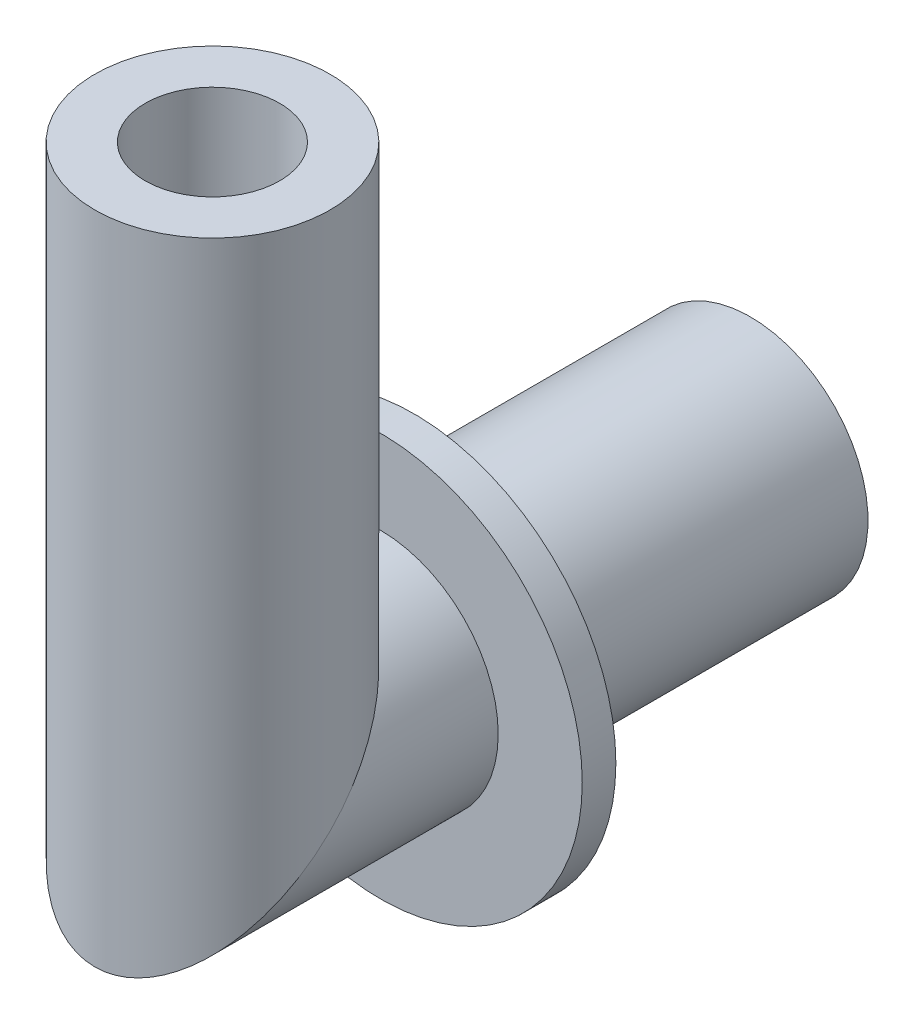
ISO-10303-21;
HEADER;
FILE_DESCRIPTION(('STEP AP214'),'2;1');
FILE_NAME('part.step','',(''),(''),'','','');
FILE_SCHEMA(('AUTOMOTIVE_DESIGN { 1 0 10303 214 1 1 1 1 }'));
ENDSEC;
DATA;
#1=APPLICATION_CONTEXT('core data for automotive mechanical design processes');
#2=APPLICATION_PROTOCOL_DEFINITION('international standard','automotive_design',2000,#1);
#3=PRODUCT_CONTEXT('',#1,'mechanical');
#4=PRODUCT('Part','Part','',(#3));
#5=PRODUCT_RELATED_PRODUCT_CATEGORY('part','',(#4));
#6=PRODUCT_DEFINITION_FORMATION('','',#4);
#7=PRODUCT_DEFINITION_CONTEXT('part definition',#1,'design');
#8=PRODUCT_DEFINITION('design','',#6,#7);
#9=PRODUCT_DEFINITION_SHAPE('','',#8);
#10=(LENGTH_UNIT() NAMED_UNIT(*) SI_UNIT(.MILLI.,.METRE.));
#11=(NAMED_UNIT(*) PLANE_ANGLE_UNIT() SI_UNIT($,.RADIAN.));
#12=(NAMED_UNIT(*) SI_UNIT($,.STERADIAN.) SOLID_ANGLE_UNIT());
#13=UNCERTAINTY_MEASURE_WITH_UNIT(LENGTH_MEASURE(1.E-05),#10,'distance_accuracy_value','');
#14=(GEOMETRIC_REPRESENTATION_CONTEXT(3) GLOBAL_UNCERTAINTY_ASSIGNED_CONTEXT((#13)) GLOBAL_UNIT_ASSIGNED_CONTEXT((#10,
#11,#12)) REPRESENTATION_CONTEXT('',''));
#15=CARTESIAN_POINT('',(0.,0.,0.));
#16=DIRECTION('',(0.,0.,1.));
#17=DIRECTION('',(1.,0.,0.));
#18=AXIS2_PLACEMENT_3D('',#15,#16,#17);
#19=CARTESIAN_POINT('',(0.,-25.4,44.3702241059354));
#20=DIRECTION('',(0.,0.,-1.));
#21=DIRECTION('',(-1.,0.,0.));
#22=AXIS2_PLACEMENT_3D('',#19,#20,#21);
#23=CYLINDRICAL_SURFACE('',#22,5.55625);
#24=CARTESIAN_POINT('',(0.,-25.4,15.8749999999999));
#25=DIRECTION('',(0.,0.,1.));
#26=DIRECTION('',(1.,0.,0.));
#27=AXIS2_PLACEMENT_3D('',#24,#25,#26);
#28=CIRCLE('',#27,5.55625);
#29=CARTESIAN_POINT('',(-5.55625,-25.4,15.8749999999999));
#30=VERTEX_POINT('',#29);
#31=EDGE_CURVE('E69',#30,#30,#28,.T.);
#32=CARTESIAN_POINT('',(0.,-25.4,0.));
#33=DIRECTION('',(0.,0.,1.));
#34=DIRECTION('',(1.,0.,0.));
#35=AXIS2_PLACEMENT_3D('',#32,#33,#34);
#36=CIRCLE('',#35,5.55625);
#37=CARTESIAN_POINT('',(-5.55625,-25.4,0.));
#38=VERTEX_POINT('',#37);
#39=EDGE_CURVE('E34',#38,#38,#36,.T.);
#40=CARTESIAN_POINT('',(-5.55625,-25.4,15.8749999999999));
#41=CARTESIAN_POINT('',(-5.55625,-25.4,15.7096354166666));
#42=CARTESIAN_POINT('',(-5.55625,-25.4,15.5442708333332));
#43=CARTESIAN_POINT('',(-5.55625,-25.4,15.2135416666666));
#44=CARTESIAN_POINT('',(-5.55625,-25.4,15.0481770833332));
#45=CARTESIAN_POINT('',(-5.55625,-25.4,14.7174479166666));
#46=CARTESIAN_POINT('',(-5.55625,-25.4,14.5520833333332));
#47=CARTESIAN_POINT('',(-5.55625,-25.4,14.2213541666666));
#48=CARTESIAN_POINT('',(-5.55625,-25.4,14.0559895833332));
#49=CARTESIAN_POINT('',(-5.55625,-25.4,13.7252604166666));
#50=CARTESIAN_POINT('',(-5.55625,-25.4,13.5598958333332));
#51=CARTESIAN_POINT('',(-5.55625,-25.4,13.2291666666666));
#52=CARTESIAN_POINT('',(-5.55625,-25.4,13.0638020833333));
#53=CARTESIAN_POINT('',(-5.55625,-25.4,12.7330729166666));
#54=CARTESIAN_POINT('',(-5.55625,-25.4,12.5677083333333));
#55=CARTESIAN_POINT('',(-5.55625,-25.4,12.2369791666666));
#56=CARTESIAN_POINT('',(-5.55625,-25.4,12.0716145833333));
#57=CARTESIAN_POINT('',(-5.55625,-25.4,11.7408854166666));
#58=CARTESIAN_POINT('',(-5.55625,-25.4,11.5755208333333));
#59=CARTESIAN_POINT('',(-5.55625,-25.4,11.2447916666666));
#60=CARTESIAN_POINT('',(-5.55625,-25.4,11.0794270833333));
#61=CARTESIAN_POINT('',(-5.55625,-25.4,10.7486979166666));
#62=CARTESIAN_POINT('',(-5.55625,-25.4,10.5833333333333));
#63=CARTESIAN_POINT('',(-5.55625,-25.4,10.2526041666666));
#64=CARTESIAN_POINT('',(-5.55625,-25.4,10.0872395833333));
#65=CARTESIAN_POINT('',(-5.55625,-25.4,9.75651041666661));
#66=CARTESIAN_POINT('',(-5.55625,-25.4,9.59114583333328));
#67=CARTESIAN_POINT('',(-5.55625,-25.4,9.26041666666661));
#68=CARTESIAN_POINT('',(-5.55625,-25.4,9.09505208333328));
#69=CARTESIAN_POINT('',(-5.55625,-25.4,8.76432291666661));
#70=CARTESIAN_POINT('',(-5.55625,-25.4,8.59895833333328));
#71=CARTESIAN_POINT('',(-5.55625,-25.4,8.26822916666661));
#72=CARTESIAN_POINT('',(-5.55625,-25.4,8.10286458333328));
#73=CARTESIAN_POINT('',(-5.55625,-25.4,7.77213541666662));
#74=CARTESIAN_POINT('',(-5.55625,-25.4,7.60677083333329));
#75=CARTESIAN_POINT('',(-5.55625,-25.4,7.27604166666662));
#76=CARTESIAN_POINT('',(-5.55625,-25.4,7.11067708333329));
#77=CARTESIAN_POINT('',(-5.55625,-25.4,6.77994791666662));
#78=CARTESIAN_POINT('',(-5.55625,-25.4,6.61458333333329));
#79=CARTESIAN_POINT('',(-5.55625,-25.4,6.28385416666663));
#80=CARTESIAN_POINT('',(-5.55625,-25.4,6.11848958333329));
#81=CARTESIAN_POINT('',(-5.55625,-25.4,5.78776041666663));
#82=CARTESIAN_POINT('',(-5.55625,-25.4,5.6223958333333));
#83=CARTESIAN_POINT('',(-5.55625,-25.4,5.29166666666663));
#84=CARTESIAN_POINT('',(-5.55625,-25.4,5.1263020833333));
#85=CARTESIAN_POINT('',(-5.55625,-25.4,4.79557291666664));
#86=CARTESIAN_POINT('',(-5.55625,-25.4,4.63020833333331));
#87=CARTESIAN_POINT('',(-5.55625,-25.4,4.29947916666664));
#88=CARTESIAN_POINT('',(-5.55625,-25.4,4.13411458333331));
#89=CARTESIAN_POINT('',(-5.55625,-25.4,3.80338541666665));
#90=CARTESIAN_POINT('',(-5.55625,-25.4,3.63802083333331));
#91=CARTESIAN_POINT('',(-5.55625,-25.4,3.30729166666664));
#92=CARTESIAN_POINT('',(-5.55625,-25.4,3.14192708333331));
#93=CARTESIAN_POINT('',(-5.55625,-25.4,2.81119791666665));
#94=CARTESIAN_POINT('',(-5.55625,-25.4,2.64583333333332));
#95=CARTESIAN_POINT('',(-5.55625,-25.4,2.31510416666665));
#96=CARTESIAN_POINT('',(-5.55625,-25.4,2.14973958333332));
#97=CARTESIAN_POINT('',(-5.55625,-25.4,1.81901041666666));
#98=CARTESIAN_POINT('',(-5.55625,-25.4,1.65364583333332));
#99=CARTESIAN_POINT('',(-5.55625,-25.4,1.32291666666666));
#100=CARTESIAN_POINT('',(-5.55625,-25.4,1.15755208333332));
#101=CARTESIAN_POINT('',(-5.55625,-25.4,0.826822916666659));
#102=CARTESIAN_POINT('',(-5.55625,-25.4,0.661458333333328));
#103=CARTESIAN_POINT('',(-5.55625,-25.4,0.330729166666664));
#104=CARTESIAN_POINT('',(-5.55625,-25.4,0.165364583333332));
#105=CARTESIAN_POINT('',(-5.55625,-25.4,0.));
#106=B_SPLINE_CURVE_WITH_KNOTS('',3,(#40,#41,#42,#43,#44,#45,#46,#47,#48,#49,#50,#51,#52,#53,
#54,#55,#56,#57,#58,#59,#60,#61,#62,#63,#64,#65,#66,#67,#68,#69,#70,#71,#72,#73,#74,#75,#76,#77,
#78,#79,#80,#81,#82,#83,#84,#85,#86,#87,#88,#89,#90,#91,#92,#93,#94,#95,#96,#97,#98,#99,#100,
#101,#102,#103,#104,#105),.UNSPECIFIED.,.F.,.F.,(4,2,2,2,2,2,2,2,2,2,2,2,2,2,2,2,2,2,2,2,2,2,2,
2,2,2,2,2,2,2,2,2,4),(0.,0.496093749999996,0.992187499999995,1.48828124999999,1.98437499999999,
2.48046874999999,2.97656249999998,3.47265624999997,3.96874999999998,4.46484374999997,
4.96093749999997,5.45703124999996,5.95312499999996,6.44921874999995,6.94531249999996,
7.44140624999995,7.93749999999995,8.43359374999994,8.92968749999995,9.42578124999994,
9.92187499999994,10.4179687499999,10.9140624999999,11.4101562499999,11.9062499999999,
12.4023437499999,12.8984374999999,13.3945312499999,13.8906249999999,14.3867187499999,
14.8828124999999,15.3789062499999,15.8749999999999),.UNSPECIFIED.);
#107=EDGE_CURVE('BSEAM30',#30,#38,#106,.T.);
#108=ORIENTED_EDGE('',*,*,#31,.F.);
#109=ORIENTED_EDGE('',*,*,#39,.T.);
#110=ORIENTED_EDGE('',*,*,#107,.T.);
#111=ORIENTED_EDGE('',*,*,#107,.F.);
#112=EDGE_LOOP('',(#108,#110,#109,#111));
#113=FACE_BOUND('',#112,.T.);
#114=ADVANCED_FACE('F30',(#113),#23,.T.);
#115=CARTESIAN_POINT('',(0.,-25.4,17.4624999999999));
#116=DIRECTION('',(0.,0.,1.));
#117=DIRECTION('',(1.,0.,0.));
#118=AXIS2_PLACEMENT_3D('',#115,#116,#117);
#119=CIRCLE('',#118,5.55625);
#120=CARTESIAN_POINT('',(5.55625,-25.4,17.4624999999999));
#121=VERTEX_POINT('',#120);
#122=EDGE_CURVE('E66',#121,#121,#119,.T.);
#123=ORIENTED_EDGE('',*,*,#122,.T.);
#124=EDGE_LOOP('',(#123));
#125=FACE_BOUND('',#124,.T.);
#126=CARTESIAN_POINT('',(0.,-25.4,25.3999999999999));
#127=DIRECTION('',(0.,0.707106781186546,0.707106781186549));
#128=DIRECTION('',(0.,0.707106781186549,-0.707106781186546));
#129=AXIS2_PLACEMENT_3D('',#126,#127,#128);
#130=ELLIPSE('',#129,7.8577241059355,5.55625);
#131=CARTESIAN_POINT('',(0.,-19.84375,19.8437499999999));
#132=VERTEX_POINT('',#131);
#133=EDGE_CURVE('E10',#132,#132,#130,.T.);
#134=ORIENTED_EDGE('',*,*,#133,.F.);
#135=EDGE_LOOP('',(#134));
#136=FACE_BOUND('',#135,.T.);
#137=ADVANCED_FACE('F32',(#125,#136),#23,.T.);
#138=CARTESIAN_POINT('',(0.,-25.4,0.));
#139=DIRECTION('',(0.,0.,1.));
#140=DIRECTION('',(1.,0.,0.));
#141=AXIS2_PLACEMENT_3D('',#138,#139,#140);
#142=PLANE('',#141);
#143=ORIENTED_EDGE('',*,*,#39,.F.);
#144=EDGE_LOOP('',(#143));
#145=FACE_BOUND('',#144,.T.);
#146=CARTESIAN_POINT('',(0.,-25.4,0.));
#147=DIRECTION('',(0.,0.,1.));
#148=DIRECTION('',(1.,0.,0.));
#149=AXIS2_PLACEMENT_3D('',#146,#147,#148);
#150=CIRCLE('',#149,3.175);
#151=CARTESIAN_POINT('',(3.175,-25.4,0.));
#152=VERTEX_POINT('',#151);
#153=EDGE_CURVE('E42',#152,#152,#150,.T.);
#154=ORIENTED_EDGE('',*,*,#153,.T.);
#155=EDGE_LOOP('',(#154));
#156=FACE_BOUND('',#155,.T.);
#157=ADVANCED_FACE('F80',(#145,#156),#142,.F.);
#158=CARTESIAN_POINT('',(0.,-25.4,44.3702241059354));
#159=DIRECTION('',(0.,0.,-1.));
#160=DIRECTION('',(-1.,0.,0.));
#161=AXIS2_PLACEMENT_3D('',#158,#159,#160);
#162=CYLINDRICAL_SURFACE('',#161,3.175);
#163=ORIENTED_EDGE('',*,*,#153,.F.);
#164=EDGE_LOOP('',(#163));
#165=FACE_BOUND('',#164,.T.);
#166=CARTESIAN_POINT('',(0.,-25.4,25.3999999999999));
#167=DIRECTION('',(0.,0.707106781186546,0.707106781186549));
#168=DIRECTION('',(0.,0.707106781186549,-0.707106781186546));
#169=AXIS2_PLACEMENT_3D('',#166,#167,#168);
#170=ELLIPSE('',#169,4.49012806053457,3.17499999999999);
#171=CARTESIAN_POINT('',(0.,-22.225,22.2249999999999));
#172=VERTEX_POINT('',#171);
#173=EDGE_CURVE('E44',#172,#172,#170,.F.);
#174=ORIENTED_EDGE('',*,*,#173,.F.);
#175=EDGE_LOOP('',(#174));
#176=FACE_BOUND('',#175,.T.);
#177=ADVANCED_FACE('F82',(#165,#176),#162,.F.);
#178=CARTESIAN_POINT('',(0.,-44.3702241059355,25.3999999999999));
#179=DIRECTION('',(0.,1.,0.));
#180=DIRECTION('',(0.,0.,1.));
#181=AXIS2_PLACEMENT_3D('',#178,#179,#180);
#182=CYLINDRICAL_SURFACE('',#181,5.55624999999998);
#183=ORIENTED_EDGE('',*,*,#133,.T.);
#184=EDGE_LOOP('',(#183));
#185=FACE_BOUND('',#184,.T.);
#186=CARTESIAN_POINT('',(0.,0.,25.3999999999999));
#187=DIRECTION('',(0.,1.,0.));
#188=DIRECTION('',(0.,0.,1.));
#189=AXIS2_PLACEMENT_3D('',#186,#187,#188);
#190=CIRCLE('',#189,5.55624999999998);
#191=CARTESIAN_POINT('',(0.,0.,30.9562499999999));
#192=VERTEX_POINT('',#191);
#193=EDGE_CURVE('E50',#192,#192,#190,.T.);
#194=ORIENTED_EDGE('',*,*,#193,.F.);
#195=EDGE_LOOP('',(#194));
#196=FACE_BOUND('',#195,.T.);
#197=ADVANCED_FACE('F87',(#185,#196),#182,.T.);
#198=CARTESIAN_POINT('',(0.,0.,25.3999999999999));
#199=DIRECTION('',(0.,1.,0.));
#200=DIRECTION('',(0.,0.,1.));
#201=AXIS2_PLACEMENT_3D('',#198,#199,#200);
#202=PLANE('',#201);
#203=CARTESIAN_POINT('',(0.,0.,25.3999999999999));
#204=DIRECTION('',(0.,1.,0.));
#205=DIRECTION('',(0.,0.,1.));
#206=AXIS2_PLACEMENT_3D('',#203,#204,#205);
#207=CIRCLE('',#206,3.17499999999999);
#208=CARTESIAN_POINT('',(0.,0.,28.5749999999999));
#209=VERTEX_POINT('',#208);
#210=EDGE_CURVE('E54',#209,#209,#207,.T.);
#211=ORIENTED_EDGE('',*,*,#210,.F.);
#212=EDGE_LOOP('',(#211));
#213=FACE_BOUND('',#212,.T.);
#214=ORIENTED_EDGE('',*,*,#193,.T.);
#215=EDGE_LOOP('',(#214));
#216=FACE_BOUND('',#215,.T.);
#217=ADVANCED_FACE('F94',(#213,#216),#202,.T.);
#218=CARTESIAN_POINT('',(0.,-44.3702241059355,25.3999999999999));
#219=DIRECTION('',(0.,1.,0.));
#220=DIRECTION('',(0.,0.,1.));
#221=AXIS2_PLACEMENT_3D('',#218,#219,#220);
#222=CYLINDRICAL_SURFACE('',#221,3.17499999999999);
#223=ORIENTED_EDGE('',*,*,#173,.T.);
#224=EDGE_LOOP('',(#223));
#225=FACE_BOUND('',#224,.T.);
#226=ORIENTED_EDGE('',*,*,#210,.T.);
#227=EDGE_LOOP('',(#226));
#228=FACE_BOUND('',#227,.T.);
#229=ADVANCED_FACE('F97',(#225,#228),#222,.F.);
#230=CARTESIAN_POINT('',(0.,-30.95625,15.8749999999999));
#231=DIRECTION('',(0.,0.,-1.));
#232=DIRECTION('',(-1.,0.,0.));
#233=AXIS2_PLACEMENT_3D('',#230,#231,#232);
#234=PLANE('',#233);
#235=ORIENTED_EDGE('',*,*,#31,.T.);
#236=EDGE_LOOP('',(#235));
#237=FACE_BOUND('',#236,.T.);
#238=CARTESIAN_POINT('',(0.,-25.4,15.8749999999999));
#239=DIRECTION('',(0.,0.,1.));
#240=DIRECTION('',(1.,0.,0.));
#241=AXIS2_PLACEMENT_3D('',#238,#239,#240);
#242=CIRCLE('',#241,9.525);
#243=CARTESIAN_POINT('',(9.525,-25.4,15.8749999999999));
#244=VERTEX_POINT('',#243);
#245=EDGE_CURVE('E58',#244,#244,#242,.T.);
#246=ORIENTED_EDGE('',*,*,#245,.F.);
#247=EDGE_LOOP('',(#246));
#248=FACE_BOUND('',#247,.T.);
#249=ADVANCED_FACE('F73',(#237,#248),#234,.T.);
#250=CARTESIAN_POINT('',(0.,-25.4,30.9562499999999));
#251=DIRECTION('',(0.,0.,1.));
#252=DIRECTION('',(1.,0.,0.));
#253=AXIS2_PLACEMENT_3D('',#250,#251,#252);
#254=CYLINDRICAL_SURFACE('',#253,9.525);
#255=ORIENTED_EDGE('',*,*,#245,.T.);
#256=EDGE_LOOP('',(#255));
#257=FACE_BOUND('',#256,.T.);
#258=CARTESIAN_POINT('',(0.,-25.4,17.4624999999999));
#259=DIRECTION('',(0.,0.,1.));
#260=DIRECTION('',(1.,0.,0.));
#261=AXIS2_PLACEMENT_3D('',#258,#259,#260);
#262=CIRCLE('',#261,9.52499999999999);
#263=CARTESIAN_POINT('',(9.52499999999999,-25.4,17.4624999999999));
#264=VERTEX_POINT('',#263);
#265=EDGE_CURVE('E63',#264,#264,#262,.T.);
#266=ORIENTED_EDGE('',*,*,#265,.F.);
#267=EDGE_LOOP('',(#266));
#268=FACE_BOUND('',#267,.T.);
#269=ADVANCED_FACE('F103',(#257,#268),#254,.T.);
#270=CARTESIAN_POINT('',(0.,-30.95625,17.4624999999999));
#271=DIRECTION('',(0.,0.,1.));
#272=DIRECTION('',(1.,0.,0.));
#273=AXIS2_PLACEMENT_3D('',#270,#271,#272);
#274=PLANE('',#273);
#275=ORIENTED_EDGE('',*,*,#265,.T.);
#276=EDGE_LOOP('',(#275));
#277=FACE_BOUND('',#276,.T.);
#278=ORIENTED_EDGE('',*,*,#122,.F.);
#279=EDGE_LOOP('',(#278));
#280=FACE_BOUND('',#279,.T.);
#281=ADVANCED_FACE('F106',(#277,#280),#274,.T.);
#282=CLOSED_SHELL('',(#114,#137,#157,#177,#197,#217,#229,#249,#269,#281));
#283=MANIFOLD_SOLID_BREP('B2',#282);
#284=ADVANCED_BREP_SHAPE_REPRESENTATION('',(#18,#283),#14);
#285=SHAPE_DEFINITION_REPRESENTATION(#9,#284);
ENDSEC;
END-ISO-10303-21;
